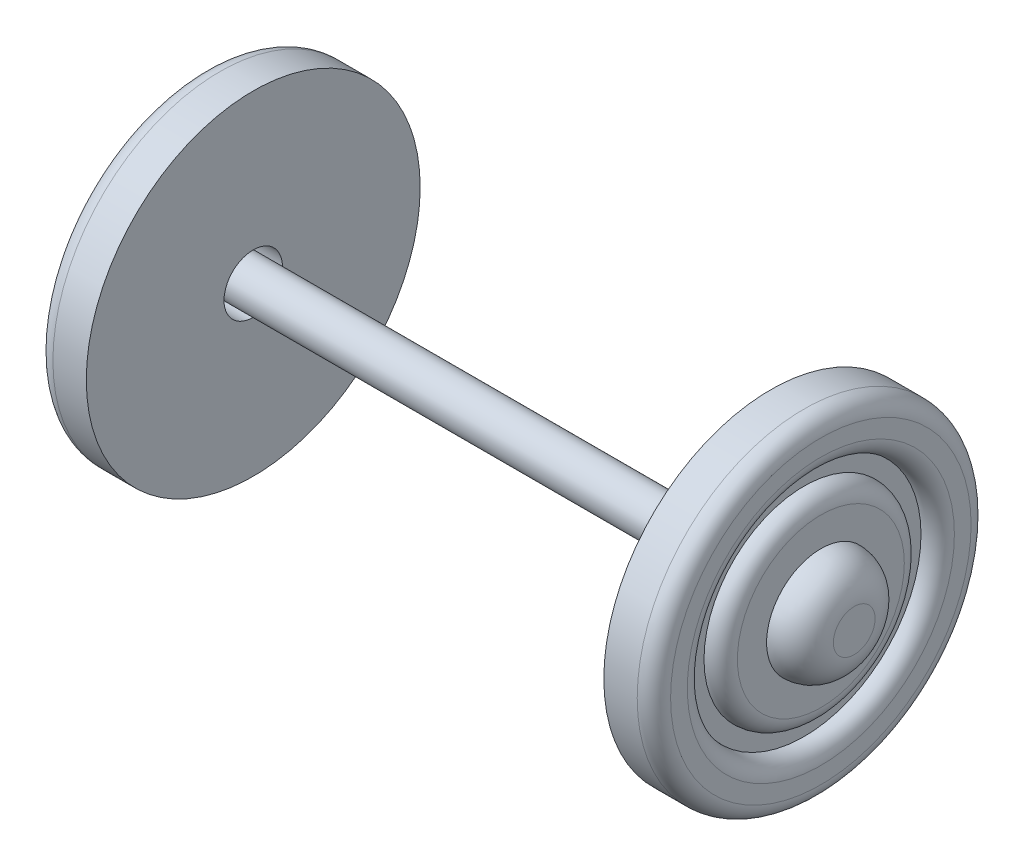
ISO-10303-21;
HEADER;
FILE_DESCRIPTION(('STEP AP214'),'2;1');
FILE_NAME('part.step','',(''),(''),'','','');
FILE_SCHEMA(('AUTOMOTIVE_DESIGN { 1 0 10303 214 1 1 1 1 }'));
ENDSEC;
DATA;
#1=APPLICATION_CONTEXT('core data for automotive mechanical design processes');
#2=APPLICATION_PROTOCOL_DEFINITION('international standard','automotive_design',2000,#1);
#3=PRODUCT_CONTEXT('',#1,'mechanical');
#4=PRODUCT('Part','Part','',(#3));
#5=PRODUCT_RELATED_PRODUCT_CATEGORY('part','',(#4));
#6=PRODUCT_DEFINITION_FORMATION('','',#4);
#7=PRODUCT_DEFINITION_CONTEXT('part definition',#1,'design');
#8=PRODUCT_DEFINITION('design','',#6,#7);
#9=PRODUCT_DEFINITION_SHAPE('','',#8);
#10=(LENGTH_UNIT() NAMED_UNIT(*) SI_UNIT(.MILLI.,.METRE.));
#11=(NAMED_UNIT(*) PLANE_ANGLE_UNIT() SI_UNIT($,.RADIAN.));
#12=(NAMED_UNIT(*) SI_UNIT($,.STERADIAN.) SOLID_ANGLE_UNIT());
#13=UNCERTAINTY_MEASURE_WITH_UNIT(LENGTH_MEASURE(1.E-05),#10,'distance_accuracy_value','');
#14=(GEOMETRIC_REPRESENTATION_CONTEXT(3) GLOBAL_UNCERTAINTY_ASSIGNED_CONTEXT((#13)) GLOBAL_UNIT_ASSIGNED_CONTEXT((#10,
#11,#12)) REPRESENTATION_CONTEXT('',''));
#15=CARTESIAN_POINT('',(0.,0.,0.));
#16=DIRECTION('',(0.,0.,1.));
#17=DIRECTION('',(1.,0.,0.));
#18=AXIS2_PLACEMENT_3D('',#15,#16,#17);
#19=CARTESIAN_POINT('',(-15.5,0.,0.));
#20=DIRECTION('',(1.,0.,0.));
#21=DIRECTION('',(0.,0.,1.));
#22=AXIS2_PLACEMENT_3D('',#19,#20,#21);
#23=PLANE('',#22);
#24=CARTESIAN_POINT('',(-15.5,0.,0.));
#25=DIRECTION('',(-1.,0.,0.));
#26=DIRECTION('',(0.,0.,1.));
#27=AXIS2_PLACEMENT_3D('',#24,#25,#26);
#28=CIRCLE('',#27,10.);
#29=CARTESIAN_POINT('',(-15.5,0.,10.));
#30=VERTEX_POINT('',#29);
#31=EDGE_CURVE('E73',#30,#30,#28,.T.);
#32=ORIENTED_EDGE('',*,*,#31,.F.);
#33=EDGE_LOOP('',(#32));
#34=FACE_BOUND('',#33,.T.);
#35=CARTESIAN_POINT('',(-15.5,0.,0.));
#36=DIRECTION('',(-1.,0.,0.));
#37=DIRECTION('',(0.,0.,1.));
#38=AXIS2_PLACEMENT_3D('',#35,#36,#37);
#39=CIRCLE('',#38,1.75);
#40=CARTESIAN_POINT('',(-15.5,0.,1.75));
#41=VERTEX_POINT('',#40);
#42=EDGE_CURVE('E76',#41,#41,#39,.T.);
#43=ORIENTED_EDGE('',*,*,#42,.T.);
#44=EDGE_LOOP('',(#43));
#45=FACE_BOUND('',#44,.T.);
#46=ADVANCED_FACE('F50',(#34,#45),#23,.T.);
#47=CARTESIAN_POINT('',(-17.5,0.,0.));
#48=DIRECTION('',(1.,0.,0.));
#49=DIRECTION('',(0.,0.,1.));
#50=AXIS2_PLACEMENT_3D('',#47,#48,#49);
#51=PLANE('',#50);
#52=CARTESIAN_POINT('',(-17.5,0.,0.));
#53=DIRECTION('',(-1.,0.,0.));
#54=DIRECTION('',(0.,0.,1.));
#55=AXIS2_PLACEMENT_3D('',#52,#53,#54);
#56=CIRCLE('',#55,6.);
#57=CARTESIAN_POINT('',(-17.5,0.,6.));
#58=VERTEX_POINT('',#57);
#59=EDGE_CURVE('E70',#58,#58,#56,.F.);
#60=ORIENTED_EDGE('',*,*,#59,.T.);
#61=EDGE_LOOP('',(#60));
#62=FACE_BOUND('',#61,.T.);
#63=CARTESIAN_POINT('',(-17.5,0.,0.));
#64=DIRECTION('',(1.,0.,0.));
#65=DIRECTION('',(0.,0.,-1.));
#66=AXIS2_PLACEMENT_3D('',#63,#64,#65);
#67=CIRCLE('',#66,7.);
#68=CARTESIAN_POINT('',(-17.5,0.,-7.));
#69=VERTEX_POINT('',#68);
#70=EDGE_CURVE('E79',#69,#69,#67,.T.);
#71=ORIENTED_EDGE('',*,*,#70,.F.);
#72=EDGE_LOOP('',(#71));
#73=FACE_BOUND('',#72,.T.);
#74=ADVANCED_FACE('F103',(#62,#73),#51,.F.);
#75=CARTESIAN_POINT('',(-15.5,0.,0.));
#76=DIRECTION('',(-1.,0.,0.));
#77=DIRECTION('',(0.,0.,-1.));
#78=AXIS2_PLACEMENT_3D('',#75,#76,#77);
#79=CYLINDRICAL_SURFACE('',#78,10.);
#80=CARTESIAN_POINT('',(-17.5,0.,0.));
#81=DIRECTION('',(1.,0.,0.));
#82=DIRECTION('',(0.,0.,-1.));
#83=AXIS2_PLACEMENT_3D('',#80,#81,#82);
#84=CIRCLE('',#83,10.);
#85=CARTESIAN_POINT('',(-17.5,0.,-10.));
#86=VERTEX_POINT('',#85);
#87=EDGE_CURVE('E57',#86,#86,#84,.F.);
#88=ORIENTED_EDGE('',*,*,#87,.F.);
#89=EDGE_LOOP('',(#88));
#90=FACE_BOUND('',#89,.T.);
#91=ORIENTED_EDGE('',*,*,#31,.T.);
#92=EDGE_LOOP('',(#91));
#93=FACE_BOUND('',#92,.T.);
#94=ADVANCED_FACE('F109',(#90,#93),#79,.T.);
#95=CARTESIAN_POINT('',(-15.5,0.,0.));
#96=DIRECTION('',(-1.,0.,0.));
#97=DIRECTION('',(0.,0.,-1.));
#98=AXIS2_PLACEMENT_3D('',#95,#96,#97);
#99=CYLINDRICAL_SURFACE('',#98,1.75);
#100=ORIENTED_EDGE('',*,*,#42,.F.);
#101=EDGE_LOOP('',(#100));
#102=FACE_BOUND('',#101,.T.);
#103=CARTESIAN_POINT('',(-18.5,0.,0.));
#104=DIRECTION('',(1.,0.,0.));
#105=DIRECTION('',(0.,0.,-1.));
#106=AXIS2_PLACEMENT_3D('',#103,#104,#105);
#107=CIRCLE('',#106,1.75);
#108=CARTESIAN_POINT('',(-18.5,0.,-1.75));
#109=VERTEX_POINT('',#108);
#110=EDGE_CURVE('E82',#109,#109,#107,.F.);
#111=ORIENTED_EDGE('',*,*,#110,.T.);
#112=EDGE_LOOP('',(#111));
#113=FACE_BOUND('',#112,.T.);
#114=ADVANCED_FACE('F86',(#102,#113),#99,.F.);
#115=CARTESIAN_POINT('',(-18.5,0.,0.));
#116=DIRECTION('',(-1.,0.,0.));
#117=DIRECTION('',(0.,0.,-1.));
#118=AXIS2_PLACEMENT_3D('',#115,#116,#117);
#119=PLANE('',#118);
#120=CARTESIAN_POINT('',(-18.5,0.,0.));
#121=DIRECTION('',(1.,0.,0.));
#122=DIRECTION('',(0.,0.,-1.));
#123=AXIS2_PLACEMENT_3D('',#120,#121,#122);
#124=CIRCLE('',#123,9.);
#125=CARTESIAN_POINT('',(-18.5,0.,-9.));
#126=VERTEX_POINT('',#125);
#127=EDGE_CURVE('E61',#126,#126,#124,.T.);
#128=ORIENTED_EDGE('',*,*,#127,.F.);
#129=EDGE_LOOP('',(#128));
#130=FACE_BOUND('',#129,.T.);
#131=CARTESIAN_POINT('',(-18.5,0.,0.));
#132=DIRECTION('',(1.,0.,0.));
#133=DIRECTION('',(0.,0.,-1.));
#134=AXIS2_PLACEMENT_3D('',#131,#132,#133);
#135=CIRCLE('',#134,8.);
#136=CARTESIAN_POINT('',(-18.5,0.,-8.));
#137=VERTEX_POINT('',#136);
#138=EDGE_CURVE('E65',#137,#137,#135,.F.);
#139=ORIENTED_EDGE('',*,*,#138,.F.);
#140=EDGE_LOOP('',(#139));
#141=FACE_BOUND('',#140,.T.);
#142=ADVANCED_FACE('F91',(#130,#141),#119,.T.);
#143=CARTESIAN_POINT('',(-18.5,0.,0.));
#144=DIRECTION('',(-1.,0.,0.));
#145=DIRECTION('',(0.,0.,-1.));
#146=AXIS2_PLACEMENT_3D('',#143,#144,#145);
#147=PLANE('',#146);
#148=CARTESIAN_POINT('',(-18.5,0.,0.));
#149=DIRECTION('',(1.,0.,0.));
#150=DIRECTION('',(0.,0.,-1.));
#151=AXIS2_PLACEMENT_3D('',#148,#149,#150);
#152=CIRCLE('',#151,5.);
#153=CARTESIAN_POINT('',(-18.5,0.,-5.));
#154=VERTEX_POINT('',#153);
#155=EDGE_CURVE('E12',#154,#154,#152,.T.);
#156=ORIENTED_EDGE('',*,*,#155,.F.);
#157=EDGE_LOOP('',(#156));
#158=FACE_BOUND('',#157,.T.);
#159=ORIENTED_EDGE('',*,*,#110,.F.);
#160=EDGE_LOOP('',(#159));
#161=FACE_BOUND('',#160,.T.);
#162=ADVANCED_FACE('F88',(#158,#161),#147,.T.);
#163=CARTESIAN_POINT('',(-17.5,0.,0.));
#164=DIRECTION('',(-1.,0.,0.));
#165=DIRECTION('',(0.,0.,-1.));
#166=AXIS2_PLACEMENT_3D('',#163,#164,#165);
#167=TOROIDAL_SURFACE('',#166,9.,1.);
#168=ORIENTED_EDGE('',*,*,#87,.T.);
#169=EDGE_LOOP('',(#168));
#170=FACE_BOUND('',#169,.T.);
#171=ORIENTED_EDGE('',*,*,#127,.T.);
#172=EDGE_LOOP('',(#171));
#173=FACE_BOUND('',#172,.T.);
#174=ADVANCED_FACE('F90',(#170,#173),#167,.T.);
#175=CARTESIAN_POINT('',(-17.5,0.,0.));
#176=DIRECTION('',(-1.,0.,0.));
#177=DIRECTION('',(0.,0.,-1.));
#178=AXIS2_PLACEMENT_3D('',#175,#176,#177);
#179=TOROIDAL_SURFACE('',#178,5.,1.);
#180=ORIENTED_EDGE('',*,*,#59,.F.);
#181=EDGE_LOOP('',(#180));
#182=FACE_BOUND('',#181,.T.);
#183=ORIENTED_EDGE('',*,*,#155,.T.);
#184=EDGE_LOOP('',(#183));
#185=FACE_BOUND('',#184,.T.);
#186=ADVANCED_FACE('F98',(#182,#185),#179,.T.);
#187=CARTESIAN_POINT('',(-17.5,0.,0.));
#188=DIRECTION('',(-1.,0.,0.));
#189=DIRECTION('',(0.,0.,-1.));
#190=AXIS2_PLACEMENT_3D('',#187,#188,#189);
#191=TOROIDAL_SURFACE('',#190,8.,1.);
#192=ORIENTED_EDGE('',*,*,#138,.T.);
#193=EDGE_LOOP('',(#192));
#194=FACE_BOUND('',#193,.T.);
#195=ORIENTED_EDGE('',*,*,#70,.T.);
#196=EDGE_LOOP('',(#195));
#197=FACE_BOUND('',#196,.T.);
#198=ADVANCED_FACE('F52',(#194,#197),#191,.T.);
#199=CLOSED_SHELL('',(#46,#74,#94,#114,#142,#162,#174,#186,#198));
#200=MANIFOLD_SOLID_BREP('B2',#199);
#201=CARTESIAN_POINT('',(15.5,0.,0.));
#202=DIRECTION('',(-1.,0.,0.));
#203=DIRECTION('',(0.,0.,1.));
#204=AXIS2_PLACEMENT_3D('',#201,#202,#203);
#205=PLANE('',#204);
#206=CARTESIAN_POINT('',(15.5,0.,0.));
#207=DIRECTION('',(-1.,0.,0.));
#208=DIRECTION('',(0.,0.,1.));
#209=AXIS2_PLACEMENT_3D('',#206,#207,#208);
#210=CIRCLE('',#209,10.);
#211=CARTESIAN_POINT('',(15.5,0.,10.));
#212=VERTEX_POINT('',#211);
#213=EDGE_CURVE('E259',#212,#212,#210,.T.);
#214=ORIENTED_EDGE('',*,*,#213,.T.);
#215=EDGE_LOOP('',(#214));
#216=FACE_BOUND('',#215,.T.);
#217=CARTESIAN_POINT('',(15.5,0.,0.));
#218=DIRECTION('',(-1.,0.,0.));
#219=DIRECTION('',(0.,0.,1.));
#220=AXIS2_PLACEMENT_3D('',#217,#218,#219);
#221=CIRCLE('',#220,1.75);
#222=CARTESIAN_POINT('',(15.5,0.,1.75));
#223=VERTEX_POINT('',#222);
#224=EDGE_CURVE('E262',#223,#223,#221,.T.);
#225=ORIENTED_EDGE('',*,*,#224,.F.);
#226=EDGE_LOOP('',(#225));
#227=FACE_BOUND('',#226,.T.);
#228=ADVANCED_FACE('F236',(#216,#227),#205,.T.);
#229=CARTESIAN_POINT('',(17.5,0.,0.));
#230=DIRECTION('',(-1.,0.,0.));
#231=DIRECTION('',(0.,0.,1.));
#232=AXIS2_PLACEMENT_3D('',#229,#230,#231);
#233=PLANE('',#232);
#234=CARTESIAN_POINT('',(17.5,0.,0.));
#235=DIRECTION('',(-1.,0.,0.));
#236=DIRECTION('',(0.,0.,1.));
#237=AXIS2_PLACEMENT_3D('',#234,#235,#236);
#238=CIRCLE('',#237,6.);
#239=CARTESIAN_POINT('',(17.5,0.,6.));
#240=VERTEX_POINT('',#239);
#241=EDGE_CURVE('E256',#240,#240,#238,.F.);
#242=ORIENTED_EDGE('',*,*,#241,.F.);
#243=EDGE_LOOP('',(#242));
#244=FACE_BOUND('',#243,.T.);
#245=CARTESIAN_POINT('',(17.5,0.,0.));
#246=DIRECTION('',(1.,0.,0.));
#247=DIRECTION('',(0.,0.,-1.));
#248=AXIS2_PLACEMENT_3D('',#245,#246,#247);
#249=CIRCLE('',#248,7.);
#250=CARTESIAN_POINT('',(17.5,0.,-7.));
#251=VERTEX_POINT('',#250);
#252=EDGE_CURVE('E265',#251,#251,#249,.T.);
#253=ORIENTED_EDGE('',*,*,#252,.T.);
#254=EDGE_LOOP('',(#253));
#255=FACE_BOUND('',#254,.T.);
#256=ADVANCED_FACE('F286',(#244,#255),#233,.F.);
#257=CARTESIAN_POINT('',(15.5,0.,0.));
#258=DIRECTION('',(1.,0.,0.));
#259=DIRECTION('',(0.,0.,-1.));
#260=AXIS2_PLACEMENT_3D('',#257,#258,#259);
#261=CYLINDRICAL_SURFACE('',#260,10.);
#262=CARTESIAN_POINT('',(17.5,0.,0.));
#263=DIRECTION('',(1.,0.,0.));
#264=DIRECTION('',(0.,0.,-1.));
#265=AXIS2_PLACEMENT_3D('',#262,#263,#264);
#266=CIRCLE('',#265,10.);
#267=CARTESIAN_POINT('',(17.5,0.,-10.));
#268=VERTEX_POINT('',#267);
#269=EDGE_CURVE('E243',#268,#268,#266,.F.);
#270=ORIENTED_EDGE('',*,*,#269,.T.);
#271=EDGE_LOOP('',(#270));
#272=FACE_BOUND('',#271,.T.);
#273=ORIENTED_EDGE('',*,*,#213,.F.);
#274=EDGE_LOOP('',(#273));
#275=FACE_BOUND('',#274,.T.);
#276=ADVANCED_FACE('F277',(#272,#275),#261,.T.);
#277=CARTESIAN_POINT('',(15.5,0.,0.));
#278=DIRECTION('',(1.,0.,0.));
#279=DIRECTION('',(0.,0.,-1.));
#280=AXIS2_PLACEMENT_3D('',#277,#278,#279);
#281=CYLINDRICAL_SURFACE('',#280,1.75);
#282=ORIENTED_EDGE('',*,*,#224,.T.);
#283=EDGE_LOOP('',(#282));
#284=FACE_BOUND('',#283,.T.);
#285=CARTESIAN_POINT('',(18.5,0.,0.));
#286=DIRECTION('',(1.,0.,0.));
#287=DIRECTION('',(0.,0.,-1.));
#288=AXIS2_PLACEMENT_3D('',#285,#286,#287);
#289=CIRCLE('',#288,1.75);
#290=CARTESIAN_POINT('',(18.5,0.,-1.75));
#291=VERTEX_POINT('',#290);
#292=EDGE_CURVE('E268',#291,#291,#289,.F.);
#293=ORIENTED_EDGE('',*,*,#292,.F.);
#294=EDGE_LOOP('',(#293));
#295=FACE_BOUND('',#294,.T.);
#296=ADVANCED_FACE('F274',(#284,#295),#281,.F.);
#297=CARTESIAN_POINT('',(18.5,0.,0.));
#298=DIRECTION('',(1.,0.,0.));
#299=DIRECTION('',(0.,0.,-1.));
#300=AXIS2_PLACEMENT_3D('',#297,#298,#299);
#301=PLANE('',#300);
#302=CARTESIAN_POINT('',(18.5,0.,0.));
#303=DIRECTION('',(1.,0.,0.));
#304=DIRECTION('',(0.,0.,-1.));
#305=AXIS2_PLACEMENT_3D('',#302,#303,#304);
#306=CIRCLE('',#305,9.);
#307=CARTESIAN_POINT('',(18.5,0.,-9.));
#308=VERTEX_POINT('',#307);
#309=EDGE_CURVE('E247',#308,#308,#306,.T.);
#310=ORIENTED_EDGE('',*,*,#309,.T.);
#311=EDGE_LOOP('',(#310));
#312=FACE_BOUND('',#311,.T.);
#313=CARTESIAN_POINT('',(18.5,0.,0.));
#314=DIRECTION('',(1.,0.,0.));
#315=DIRECTION('',(0.,0.,-1.));
#316=AXIS2_PLACEMENT_3D('',#313,#314,#315);
#317=CIRCLE('',#316,8.);
#318=CARTESIAN_POINT('',(18.5,0.,-8.));
#319=VERTEX_POINT('',#318);
#320=EDGE_CURVE('E251',#319,#319,#317,.F.);
#321=ORIENTED_EDGE('',*,*,#320,.T.);
#322=EDGE_LOOP('',(#321));
#323=FACE_BOUND('',#322,.T.);
#324=ADVANCED_FACE('F276',(#312,#323),#301,.T.);
#325=CARTESIAN_POINT('',(18.5,0.,0.));
#326=DIRECTION('',(1.,0.,0.));
#327=DIRECTION('',(0.,0.,-1.));
#328=AXIS2_PLACEMENT_3D('',#325,#326,#327);
#329=PLANE('',#328);
#330=CARTESIAN_POINT('',(18.5,0.,0.));
#331=DIRECTION('',(1.,0.,0.));
#332=DIRECTION('',(0.,0.,-1.));
#333=AXIS2_PLACEMENT_3D('',#330,#331,#332);
#334=CIRCLE('',#333,5.);
#335=CARTESIAN_POINT('',(18.5,0.,-5.));
#336=VERTEX_POINT('',#335);
#337=EDGE_CURVE('E49',#336,#336,#334,.T.);
#338=ORIENTED_EDGE('',*,*,#337,.T.);
#339=EDGE_LOOP('',(#338));
#340=FACE_BOUND('',#339,.T.);
#341=ORIENTED_EDGE('',*,*,#292,.T.);
#342=EDGE_LOOP('',(#341));
#343=FACE_BOUND('',#342,.T.);
#344=ADVANCED_FACE('F272',(#340,#343),#329,.T.);
#345=CARTESIAN_POINT('',(17.5,0.,0.));
#346=DIRECTION('',(1.,0.,0.));
#347=DIRECTION('',(0.,0.,-1.));
#348=AXIS2_PLACEMENT_3D('',#345,#346,#347);
#349=TOROIDAL_SURFACE('',#348,9.,1.);
#350=ORIENTED_EDGE('',*,*,#269,.F.);
#351=EDGE_LOOP('',(#350));
#352=FACE_BOUND('',#351,.T.);
#353=ORIENTED_EDGE('',*,*,#309,.F.);
#354=EDGE_LOOP('',(#353));
#355=FACE_BOUND('',#354,.T.);
#356=ADVANCED_FACE('F298',(#352,#355),#349,.T.);
#357=CARTESIAN_POINT('',(17.5,0.,0.));
#358=DIRECTION('',(1.,0.,0.));
#359=DIRECTION('',(0.,0.,-1.));
#360=AXIS2_PLACEMENT_3D('',#357,#358,#359);
#361=TOROIDAL_SURFACE('',#360,5.,1.);
#362=ORIENTED_EDGE('',*,*,#241,.T.);
#363=EDGE_LOOP('',(#362));
#364=FACE_BOUND('',#363,.T.);
#365=ORIENTED_EDGE('',*,*,#337,.F.);
#366=EDGE_LOOP('',(#365));
#367=FACE_BOUND('',#366,.T.);
#368=ADVANCED_FACE('F300',(#364,#367),#361,.T.);
#369=CARTESIAN_POINT('',(17.5,0.,0.));
#370=DIRECTION('',(1.,0.,0.));
#371=DIRECTION('',(0.,0.,-1.));
#372=AXIS2_PLACEMENT_3D('',#369,#370,#371);
#373=TOROIDAL_SURFACE('',#372,8.,1.);
#374=ORIENTED_EDGE('',*,*,#320,.F.);
#375=EDGE_LOOP('',(#374));
#376=FACE_BOUND('',#375,.T.);
#377=ORIENTED_EDGE('',*,*,#252,.F.);
#378=EDGE_LOOP('',(#377));
#379=FACE_BOUND('',#378,.T.);
#380=ADVANCED_FACE('F238',(#376,#379),#373,.T.);
#381=CLOSED_SHELL('',(#228,#256,#276,#296,#324,#344,#356,#368,#380));
#382=MANIFOLD_SOLID_BREP('B7',#381);
#383=CARTESIAN_POINT('',(18.5,0.,0.));
#384=DIRECTION('',(-1.,0.,0.));
#385=DIRECTION('',(0.,0.,1.));
#386=AXIS2_PLACEMENT_3D('',#383,#384,#385);
#387=CYLINDRICAL_SURFACE('',#386,1.25);
#388=CARTESIAN_POINT('',(18.5,0.,0.));
#389=DIRECTION('',(1.,0.,0.));
#390=DIRECTION('',(0.,0.,-1.));
#391=AXIS2_PLACEMENT_3D('',#388,#389,#390);
#392=CIRCLE('',#391,1.25);
#393=CARTESIAN_POINT('',(18.5,0.,-1.25));
#394=VERTEX_POINT('',#393);
#395=EDGE_CURVE('E396',#394,#394,#392,.T.);
#396=ORIENTED_EDGE('',*,*,#395,.F.);
#397=EDGE_LOOP('',(#396));
#398=FACE_BOUND('',#397,.T.);
#399=CARTESIAN_POINT('',(-18.5,0.,0.));
#400=DIRECTION('',(1.,0.,0.));
#401=DIRECTION('',(0.,0.,-1.));
#402=AXIS2_PLACEMENT_3D('',#399,#400,#401);
#403=CIRCLE('',#402,1.25);
#404=CARTESIAN_POINT('',(-18.5,0.,-1.25));
#405=VERTEX_POINT('',#404);
#406=EDGE_CURVE('E403',#405,#405,#403,.T.);
#407=ORIENTED_EDGE('',*,*,#406,.T.);
#408=EDGE_LOOP('',(#407));
#409=FACE_BOUND('',#408,.T.);
#410=ADVANCED_FACE('F385',(#398,#409),#387,.T.);
#411=CARTESIAN_POINT('',(20.5,0.,0.));
#412=DIRECTION('',(1.,0.,0.));
#413=DIRECTION('',(0.,0.,-1.));
#414=AXIS2_PLACEMENT_3D('',#411,#412,#413);
#415=PLANE('',#414);
#416=CARTESIAN_POINT('',(20.5,0.,0.));
#417=DIRECTION('',(1.,0.,0.));
#418=DIRECTION('',(0.,0.,-1.));
#419=AXIS2_PLACEMENT_3D('',#416,#417,#418);
#420=CIRCLE('',#419,1.25);
#421=CARTESIAN_POINT('',(20.5,0.,-1.25));
#422=VERTEX_POINT('',#421);
#423=EDGE_CURVE('E392',#422,#422,#420,.T.);
#424=ORIENTED_EDGE('',*,*,#423,.T.);
#425=EDGE_LOOP('',(#424));
#426=FACE_BOUND('',#425,.T.);
#427=ADVANCED_FACE('F428',(#426),#415,.T.);
#428=CARTESIAN_POINT('',(18.5,0.,0.));
#429=DIRECTION('',(1.,0.,0.));
#430=DIRECTION('',(0.,0.,-1.));
#431=AXIS2_PLACEMENT_3D('',#428,#429,#430);
#432=PLANE('',#431);
#433=ORIENTED_EDGE('',*,*,#395,.T.);
#434=EDGE_LOOP('',(#433));
#435=FACE_BOUND('',#434,.T.);
#436=CARTESIAN_POINT('',(18.5,0.,0.));
#437=DIRECTION('',(1.,0.,0.));
#438=DIRECTION('',(0.,0.,-1.));
#439=AXIS2_PLACEMENT_3D('',#436,#437,#438);
#440=CIRCLE('',#439,3.25);
#441=CARTESIAN_POINT('',(18.5,0.,-3.25));
#442=VERTEX_POINT('',#441);
#443=EDGE_CURVE('E400',#442,#442,#440,.T.);
#444=ORIENTED_EDGE('',*,*,#443,.F.);
#445=EDGE_LOOP('',(#444));
#446=FACE_BOUND('',#445,.T.);
#447=ADVANCED_FACE('F434',(#435,#446),#432,.F.);
#448=CARTESIAN_POINT('',(18.5,0.,0.));
#449=DIRECTION('',(1.,0.,0.));
#450=DIRECTION('',(0.,0.,-1.));
#451=AXIS2_PLACEMENT_3D('',#448,#449,#450);
#452=DEGENERATE_TOROIDAL_SURFACE('',#451,1.25,2.,.T.);
#453=ORIENTED_EDGE('',*,*,#443,.T.);
#454=EDGE_LOOP('',(#453));
#455=FACE_BOUND('',#454,.T.);
#456=ORIENTED_EDGE('',*,*,#423,.F.);
#457=EDGE_LOOP('',(#456));
#458=FACE_BOUND('',#457,.T.);
#459=ADVANCED_FACE('F423',(#455,#458),#452,.T.);
#460=CARTESIAN_POINT('',(-20.5,0.,0.));
#461=DIRECTION('',(-1.,0.,0.));
#462=DIRECTION('',(0.,0.,1.));
#463=AXIS2_PLACEMENT_3D('',#460,#461,#462);
#464=PLANE('',#463);
#465=CARTESIAN_POINT('',(-20.5,0.,0.));
#466=DIRECTION('',(-1.,0.,0.));
#467=DIRECTION('',(0.,0.,1.));
#468=AXIS2_PLACEMENT_3D('',#465,#466,#467);
#469=CIRCLE('',#468,1.25);
#470=CARTESIAN_POINT('',(-20.5,0.,1.25));
#471=VERTEX_POINT('',#470);
#472=EDGE_CURVE('E235',#471,#471,#469,.T.);
#473=ORIENTED_EDGE('',*,*,#472,.T.);
#474=EDGE_LOOP('',(#473));
#475=FACE_BOUND('',#474,.T.);
#476=ADVANCED_FACE('F416',(#475),#464,.T.);
#477=CARTESIAN_POINT('',(-18.5,0.,0.));
#478=DIRECTION('',(-1.,0.,0.));
#479=DIRECTION('',(0.,0.,1.));
#480=AXIS2_PLACEMENT_3D('',#477,#478,#479);
#481=PLANE('',#480);
#482=ORIENTED_EDGE('',*,*,#406,.F.);
#483=EDGE_LOOP('',(#482));
#484=FACE_BOUND('',#483,.T.);
#485=CARTESIAN_POINT('',(-18.5,0.,0.));
#486=DIRECTION('',(-1.,0.,0.));
#487=DIRECTION('',(0.,0.,1.));
#488=AXIS2_PLACEMENT_3D('',#485,#486,#487);
#489=CIRCLE('',#488,3.25);
#490=CARTESIAN_POINT('',(-18.5,0.,3.25));
#491=VERTEX_POINT('',#490);
#492=EDGE_CURVE('E405',#491,#491,#489,.T.);
#493=ORIENTED_EDGE('',*,*,#492,.F.);
#494=EDGE_LOOP('',(#493));
#495=FACE_BOUND('',#494,.T.);
#496=ADVANCED_FACE('F414',(#484,#495),#481,.F.);
#497=CARTESIAN_POINT('',(-18.5,0.,0.));
#498=DIRECTION('',(-1.,0.,0.));
#499=DIRECTION('',(0.,0.,1.));
#500=AXIS2_PLACEMENT_3D('',#497,#498,#499);
#501=DEGENERATE_TOROIDAL_SURFACE('',#500,1.25,2.,.T.);
#502=ORIENTED_EDGE('',*,*,#492,.T.);
#503=EDGE_LOOP('',(#502));
#504=FACE_BOUND('',#503,.T.);
#505=ORIENTED_EDGE('',*,*,#472,.F.);
#506=EDGE_LOOP('',(#505));
#507=FACE_BOUND('',#506,.T.);
#508=ADVANCED_FACE('F387',(#504,#507),#501,.T.);
#509=CLOSED_SHELL('',(#410,#427,#447,#459,#476,#496,#508));
#510=MANIFOLD_SOLID_BREP('B44',#509);
#511=ADVANCED_BREP_SHAPE_REPRESENTATION('',(#18,#200,#382,#510),#14);
#512=SHAPE_DEFINITION_REPRESENTATION(#9,#511);
ENDSEC;
END-ISO-10303-21;
